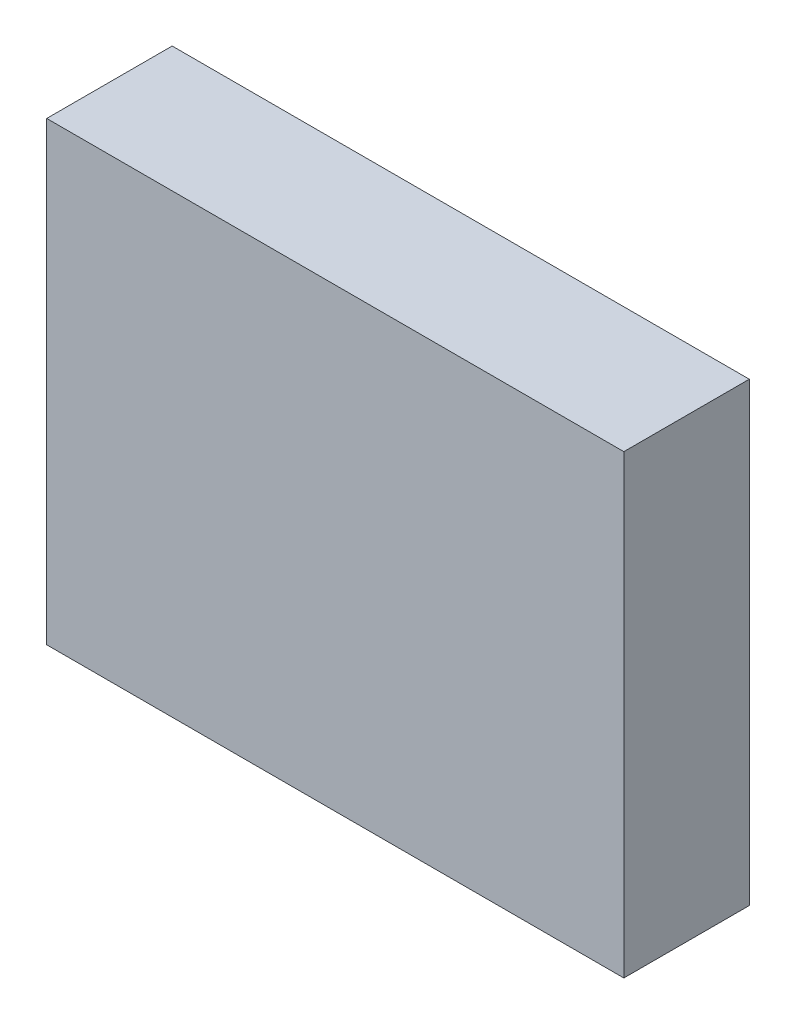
ISO-10303-21;
HEADER;
FILE_DESCRIPTION(('STEP AP214'),'2;1');
FILE_NAME('part.step','',(''),(''),'','','');
FILE_SCHEMA(('AUTOMOTIVE_DESIGN { 1 0 10303 214 1 1 1 1 }'));
ENDSEC;
DATA;
#1=APPLICATION_CONTEXT('core data for automotive mechanical design processes');
#2=APPLICATION_PROTOCOL_DEFINITION('international standard','automotive_design',2000,#1);
#3=PRODUCT_CONTEXT('',#1,'mechanical');
#4=PRODUCT('Part','Part','',(#3));
#5=PRODUCT_RELATED_PRODUCT_CATEGORY('part','',(#4));
#6=PRODUCT_DEFINITION_FORMATION('','',#4);
#7=PRODUCT_DEFINITION_CONTEXT('part definition',#1,'design');
#8=PRODUCT_DEFINITION('design','',#6,#7);
#9=PRODUCT_DEFINITION_SHAPE('','',#8);
#10=(LENGTH_UNIT() NAMED_UNIT(*) SI_UNIT(.MILLI.,.METRE.));
#11=(NAMED_UNIT(*) PLANE_ANGLE_UNIT() SI_UNIT($,.RADIAN.));
#12=(NAMED_UNIT(*) SI_UNIT($,.STERADIAN.) SOLID_ANGLE_UNIT());
#13=UNCERTAINTY_MEASURE_WITH_UNIT(LENGTH_MEASURE(1.E-05),#10,'distance_accuracy_value','');
#14=(GEOMETRIC_REPRESENTATION_CONTEXT(3) GLOBAL_UNCERTAINTY_ASSIGNED_CONTEXT((#13)) GLOBAL_UNIT_ASSIGNED_CONTEXT((#10,
#11,#12)) REPRESENTATION_CONTEXT('',''));
#15=CARTESIAN_POINT('',(0.,0.,0.));
#16=DIRECTION('',(0.,0.,1.));
#17=DIRECTION('',(1.,0.,0.));
#18=AXIS2_PLACEMENT_3D('',#15,#16,#17);
#19=CARTESIAN_POINT('',(-57.4017219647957,42.199723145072,30.));
#20=DIRECTION('',(1.,0.,0.));
#21=DIRECTION('',(0.,1.,0.));
#22=AXIS2_PLACEMENT_3D('',#19,#20,#21);
#23=PLANE('',#22);
#24=DIRECTION('',(0.,-1.,0.));
#25=VECTOR('',#24,1.);
#26=CARTESIAN_POINT('',(-57.4017219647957,42.199723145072,0.));
#27=LINE('',#26,#25);
#28=CARTESIAN_POINT('',(-57.4017219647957,42.199723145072,0.));
#29=VERTEX_POINT('',#28);
#30=CARTESIAN_POINT('',(-57.4017219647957,-66.800276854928,0.));
#31=VERTEX_POINT('',#30);
#32=EDGE_CURVE('E96',#29,#31,#27,.T.);
#33=ORIENTED_EDGE('',*,*,#32,.T.);
#34=DIRECTION('',(0.,0.,-1.));
#35=VECTOR('',#34,1.);
#36=CARTESIAN_POINT('',(-57.4017219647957,-66.800276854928,30.));
#37=LINE('',#36,#35);
#38=CARTESIAN_POINT('',(-57.4017219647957,-66.800276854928,30.));
#39=VERTEX_POINT('',#38);
#40=EDGE_CURVE('E11',#39,#31,#37,.T.);
#41=ORIENTED_EDGE('',*,*,#40,.F.);
#42=DIRECTION('',(0.,-1.,0.));
#43=VECTOR('',#42,1.);
#44=CARTESIAN_POINT('',(-57.4017219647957,42.199723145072,30.));
#45=LINE('',#44,#43);
#46=CARTESIAN_POINT('',(-57.4017219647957,42.199723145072,30.));
#47=VERTEX_POINT('',#46);
#48=EDGE_CURVE('E84',#47,#39,#45,.T.);
#49=ORIENTED_EDGE('',*,*,#48,.F.);
#50=DIRECTION('',(0.,0.,-1.));
#51=VECTOR('',#50,1.);
#52=CARTESIAN_POINT('',(-57.4017219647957,42.199723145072,30.));
#53=LINE('',#52,#51);
#54=EDGE_CURVE('E92',#47,#29,#53,.T.);
#55=ORIENTED_EDGE('',*,*,#54,.T.);
#56=EDGE_LOOP('',(#33,#41,#49,#55));
#57=FACE_BOUND('',#56,.T.);
#58=ADVANCED_FACE('F33',(#57),#23,.F.);
#59=CARTESIAN_POINT('',(-57.4017219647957,-66.800276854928,30.));
#60=DIRECTION('',(0.,1.,0.));
#61=DIRECTION('',(0.,0.,1.));
#62=AXIS2_PLACEMENT_3D('',#59,#60,#61);
#63=PLANE('',#62);
#64=DIRECTION('',(1.,0.,0.));
#65=VECTOR('',#64,1.);
#66=CARTESIAN_POINT('',(-57.4017219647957,-66.800276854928,0.));
#67=LINE('',#66,#65);
#68=CARTESIAN_POINT('',(80.5982780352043,-66.800276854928,0.));
#69=VERTEX_POINT('',#68);
#70=EDGE_CURVE('E88',#31,#69,#67,.T.);
#71=ORIENTED_EDGE('',*,*,#70,.T.);
#72=DIRECTION('',(0.,0.,-1.));
#73=VECTOR('',#72,1.);
#74=CARTESIAN_POINT('',(80.5982780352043,-66.800276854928,30.));
#75=LINE('',#74,#73);
#76=CARTESIAN_POINT('',(80.5982780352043,-66.800276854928,30.));
#77=VERTEX_POINT('',#76);
#78=EDGE_CURVE('E41',#77,#69,#75,.T.);
#79=ORIENTED_EDGE('',*,*,#78,.F.);
#80=DIRECTION('',(1.,0.,0.));
#81=VECTOR('',#80,1.);
#82=CARTESIAN_POINT('',(-57.4017219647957,-66.800276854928,30.));
#83=LINE('',#82,#81);
#84=EDGE_CURVE('E79',#39,#77,#83,.T.);
#85=ORIENTED_EDGE('',*,*,#84,.F.);
#86=ORIENTED_EDGE('',*,*,#40,.T.);
#87=EDGE_LOOP('',(#71,#79,#85,#86));
#88=FACE_BOUND('',#87,.T.);
#89=ADVANCED_FACE('F87',(#88),#63,.F.);
#90=CARTESIAN_POINT('',(80.5982780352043,42.199723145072,30.));
#91=DIRECTION('',(-1.,0.,0.));
#92=DIRECTION('',(0.,0.,1.));
#93=AXIS2_PLACEMENT_3D('',#90,#91,#92);
#94=PLANE('',#93);
#95=DIRECTION('',(0.,1.,0.));
#96=VECTOR('',#95,1.);
#97=CARTESIAN_POINT('',(80.5982780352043,42.199723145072,0.));
#98=LINE('',#97,#96);
#99=CARTESIAN_POINT('',(80.5982780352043,42.199723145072,0.));
#100=VERTEX_POINT('',#99);
#101=EDGE_CURVE('E66',#69,#100,#98,.T.);
#102=ORIENTED_EDGE('',*,*,#101,.T.);
#103=DIRECTION('',(0.,0.,-1.));
#104=VECTOR('',#103,1.);
#105=CARTESIAN_POINT('',(80.5982780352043,42.199723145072,30.));
#106=LINE('',#105,#104);
#107=CARTESIAN_POINT('',(80.5982780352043,42.199723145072,30.));
#108=VERTEX_POINT('',#107);
#109=EDGE_CURVE('E89',#108,#100,#106,.T.);
#110=ORIENTED_EDGE('',*,*,#109,.F.);
#111=DIRECTION('',(0.,1.,0.));
#112=VECTOR('',#111,1.);
#113=CARTESIAN_POINT('',(80.5982780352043,42.199723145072,30.));
#114=LINE('',#113,#112);
#115=EDGE_CURVE('E82',#77,#108,#114,.T.);
#116=ORIENTED_EDGE('',*,*,#115,.F.);
#117=ORIENTED_EDGE('',*,*,#78,.T.);
#118=EDGE_LOOP('',(#102,#110,#116,#117));
#119=FACE_BOUND('',#118,.T.);
#120=ADVANCED_FACE('F90',(#119),#94,.F.);
#121=CARTESIAN_POINT('',(-57.4017219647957,42.199723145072,30.));
#122=DIRECTION('',(0.,-1.,0.));
#123=DIRECTION('',(0.,0.,-1.));
#124=AXIS2_PLACEMENT_3D('',#121,#122,#123);
#125=PLANE('',#124);
#126=DIRECTION('',(-1.,0.,0.));
#127=VECTOR('',#126,1.);
#128=CARTESIAN_POINT('',(-57.4017219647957,42.199723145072,0.));
#129=LINE('',#128,#127);
#130=EDGE_CURVE('E72',#100,#29,#129,.T.);
#131=ORIENTED_EDGE('',*,*,#130,.T.);
#132=ORIENTED_EDGE('',*,*,#54,.F.);
#133=DIRECTION('',(-1.,0.,0.));
#134=VECTOR('',#133,1.);
#135=CARTESIAN_POINT('',(-57.4017219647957,42.199723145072,30.));
#136=LINE('',#135,#134);
#137=EDGE_CURVE('E49',#108,#47,#136,.T.);
#138=ORIENTED_EDGE('',*,*,#137,.F.);
#139=ORIENTED_EDGE('',*,*,#109,.T.);
#140=EDGE_LOOP('',(#131,#132,#138,#139));
#141=FACE_BOUND('',#140,.T.);
#142=ADVANCED_FACE('F103',(#141),#125,.F.);
#143=CARTESIAN_POINT('',(0.,0.,30.));
#144=DIRECTION('',(0.,0.,1.));
#145=DIRECTION('',(1.,0.,0.));
#146=AXIS2_PLACEMENT_3D('',#143,#144,#145);
#147=PLANE('',#146);
#148=ORIENTED_EDGE('',*,*,#48,.T.);
#149=ORIENTED_EDGE('',*,*,#84,.T.);
#150=ORIENTED_EDGE('',*,*,#115,.T.);
#151=ORIENTED_EDGE('',*,*,#137,.T.);
#152=EDGE_LOOP('',(#148,#149,#150,#151));
#153=FACE_BOUND('',#152,.T.);
#154=ADVANCED_FACE('F80',(#153),#147,.T.);
#155=CARTESIAN_POINT('',(0.,0.,0.));
#156=DIRECTION('',(0.,0.,1.));
#157=DIRECTION('',(1.,0.,0.));
#158=AXIS2_PLACEMENT_3D('',#155,#156,#157);
#159=PLANE('',#158);
#160=ORIENTED_EDGE('',*,*,#32,.F.);
#161=ORIENTED_EDGE('',*,*,#130,.F.);
#162=ORIENTED_EDGE('',*,*,#101,.F.);
#163=ORIENTED_EDGE('',*,*,#70,.F.);
#164=EDGE_LOOP('',(#160,#161,#162,#163));
#165=FACE_BOUND('',#164,.T.);
#166=ADVANCED_FACE('F106',(#165),#159,.F.);
#167=CLOSED_SHELL('',(#58,#89,#120,#142,#154,#166));
#168=MANIFOLD_SOLID_BREP('B2',#167);
#169=ADVANCED_BREP_SHAPE_REPRESENTATION('',(#18,#168),#14);
#170=SHAPE_DEFINITION_REPRESENTATION(#9,#169);
ENDSEC;
END-ISO-10303-21;
